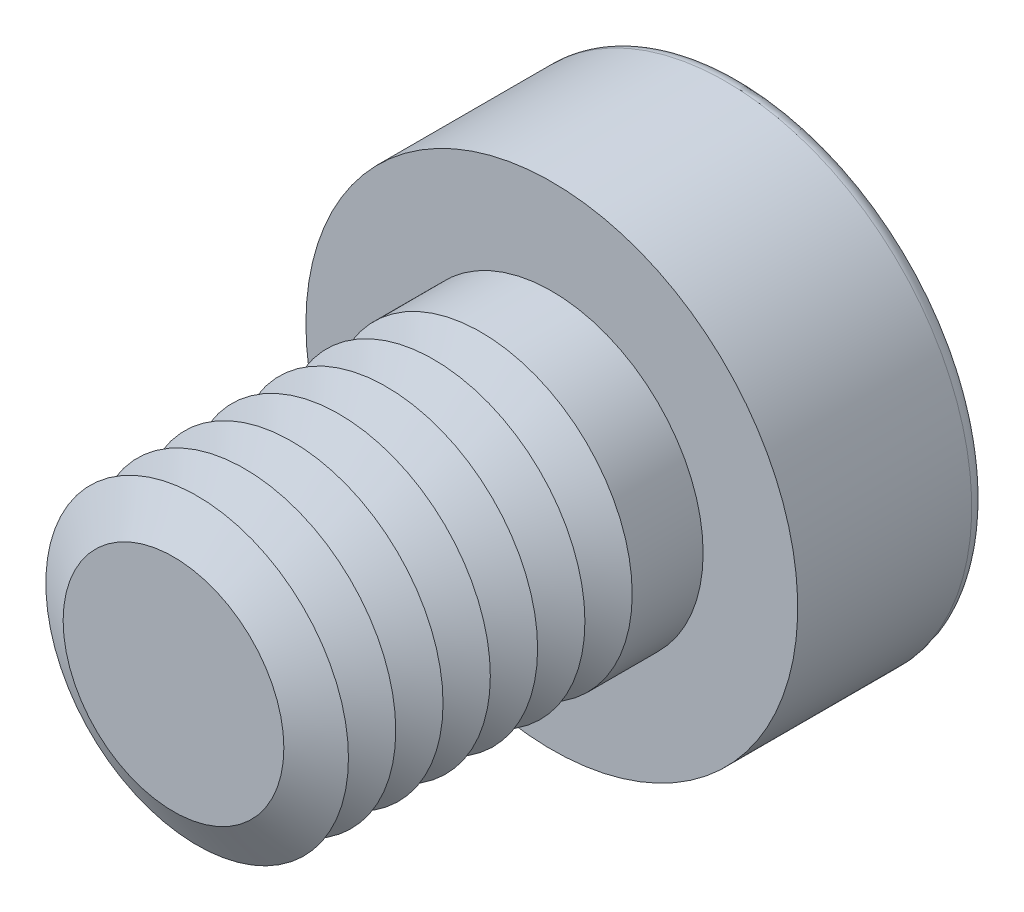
ISO-10303-21;
HEADER;
FILE_DESCRIPTION(('STEP AP214'),'2;1');
FILE_NAME('part.step','',(''),(''),'','','');
FILE_SCHEMA(('AUTOMOTIVE_DESIGN { 1 0 10303 214 1 1 1 1 }'));
ENDSEC;
DATA;
#1=APPLICATION_CONTEXT('core data for automotive mechanical design processes');
#2=APPLICATION_PROTOCOL_DEFINITION('international standard','automotive_design',2000,#1);
#3=PRODUCT_CONTEXT('',#1,'mechanical');
#4=PRODUCT('Part','Part','',(#3));
#5=PRODUCT_RELATED_PRODUCT_CATEGORY('part','',(#4));
#6=PRODUCT_DEFINITION_FORMATION('','',#4);
#7=PRODUCT_DEFINITION_CONTEXT('part definition',#1,'design');
#8=PRODUCT_DEFINITION('design','',#6,#7);
#9=PRODUCT_DEFINITION_SHAPE('','',#8);
#10=(LENGTH_UNIT() NAMED_UNIT(*) SI_UNIT(.MILLI.,.METRE.));
#11=(NAMED_UNIT(*) PLANE_ANGLE_UNIT() SI_UNIT($,.RADIAN.));
#12=(NAMED_UNIT(*) SI_UNIT($,.STERADIAN.) SOLID_ANGLE_UNIT());
#13=UNCERTAINTY_MEASURE_WITH_UNIT(LENGTH_MEASURE(1.E-05),#10,'distance_accuracy_value','');
#14=(GEOMETRIC_REPRESENTATION_CONTEXT(3) GLOBAL_UNCERTAINTY_ASSIGNED_CONTEXT((#13)) GLOBAL_UNIT_ASSIGNED_CONTEXT((#10,
#11,#12)) REPRESENTATION_CONTEXT('',''));
#15=CARTESIAN_POINT('',(0.,0.,0.));
#16=DIRECTION('',(0.,0.,1.));
#17=DIRECTION('',(1.,0.,0.));
#18=AXIS2_PLACEMENT_3D('',#15,#16,#17);
#19=CARTESIAN_POINT('',(0.,0.,5.625));
#20=DIRECTION('',(0.,0.,1.));
#21=DIRECTION('',(1.,0.,0.));
#22=AXIS2_PLACEMENT_3D('',#19,#20,#21);
#23=CONICAL_SURFACE('',#22,4.,1.0471975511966);
#24=CARTESIAN_POINT('',(0.,0.,5.));
#25=DIRECTION('',(0.,0.,1.));
#26=DIRECTION('',(1.,0.,0.));
#27=AXIS2_PLACEMENT_3D('',#24,#25,#26);
#28=CIRCLE('',#27,2.91746824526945);
#29=CARTESIAN_POINT('',(2.91746824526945,0.,5.));
#30=VERTEX_POINT('',#29);
#31=EDGE_CURVE('E313',#30,#30,#28,.T.);
#32=ORIENTED_EDGE('',*,*,#31,.T.);
#33=EDGE_LOOP('',(#32));
#34=FACE_BOUND('',#33,.T.);
#35=CARTESIAN_POINT('',(0.,0.,5.625));
#36=DIRECTION('',(0.,0.,1.));
#37=DIRECTION('',(1.,0.,0.));
#38=AXIS2_PLACEMENT_3D('',#35,#36,#37);
#39=CIRCLE('',#38,4.);
#40=CARTESIAN_POINT('',(4.,0.,5.625));
#41=VERTEX_POINT('',#40);
#42=EDGE_CURVE('E316',#41,#41,#39,.T.);
#43=ORIENTED_EDGE('',*,*,#42,.F.);
#44=EDGE_LOOP('',(#43));
#45=FACE_BOUND('',#44,.T.);
#46=ADVANCED_FACE('F39',(#34,#45),#23,.T.);
#47=CARTESIAN_POINT('',(0.,0.,5.));
#48=DIRECTION('',(0.,0.,-1.));
#49=DIRECTION('',(-1.,0.,0.));
#50=AXIS2_PLACEMENT_3D('',#47,#48,#49);
#51=CONICAL_SURFACE('',#50,2.91746824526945,1.0471975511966);
#52=CARTESIAN_POINT('',(0.,0.,4.375));
#53=DIRECTION('',(0.,0.,1.));
#54=DIRECTION('',(1.,0.,0.));
#55=AXIS2_PLACEMENT_3D('',#52,#53,#54);
#56=CIRCLE('',#55,4.);
#57=CARTESIAN_POINT('',(4.,0.,4.375));
#58=VERTEX_POINT('',#57);
#59=EDGE_CURVE('E324',#58,#58,#56,.T.);
#60=ORIENTED_EDGE('',*,*,#59,.T.);
#61=EDGE_LOOP('',(#60));
#62=FACE_BOUND('',#61,.T.);
#63=ORIENTED_EDGE('',*,*,#31,.F.);
#64=EDGE_LOOP('',(#63));
#65=FACE_BOUND('',#64,.T.);
#66=ADVANCED_FACE('F245',(#62,#65),#51,.T.);
#67=CARTESIAN_POINT('',(0.,0.,10.));
#68=DIRECTION('',(0.,0.,1.));
#69=DIRECTION('',(1.,0.,0.));
#70=AXIS2_PLACEMENT_3D('',#67,#68,#69);
#71=PLANE('',#70);
#72=CARTESIAN_POINT('',(0.,0.,10.));
#73=DIRECTION('',(0.,0.,1.));
#74=DIRECTION('',(1.,0.,0.));
#75=AXIS2_PLACEMENT_3D('',#72,#73,#74);
#76=CIRCLE('',#75,2.91746824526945);
#77=CARTESIAN_POINT('',(2.91746824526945,0.,10.));
#78=VERTEX_POINT('',#77);
#79=EDGE_CURVE('E174',#78,#78,#76,.T.);
#80=ORIENTED_EDGE('',*,*,#79,.T.);
#81=EDGE_LOOP('',(#80));
#82=FACE_BOUND('',#81,.T.);
#83=ADVANCED_FACE('F251',(#82),#71,.T.);
#84=CARTESIAN_POINT('',(0.,0.,10.));
#85=DIRECTION('',(0.,0.,-1.));
#86=DIRECTION('',(-1.,0.,0.));
#87=AXIS2_PLACEMENT_3D('',#84,#85,#86);
#88=CONICAL_SURFACE('',#87,2.91746824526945,1.0471975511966);
#89=CARTESIAN_POINT('',(0.,0.,9.375));
#90=DIRECTION('',(0.,0.,1.));
#91=DIRECTION('',(1.,0.,0.));
#92=AXIS2_PLACEMENT_3D('',#89,#90,#91);
#93=CIRCLE('',#92,4.);
#94=CARTESIAN_POINT('',(4.,0.,9.375));
#95=VERTEX_POINT('',#94);
#96=EDGE_CURVE('E291',#95,#95,#93,.T.);
#97=ORIENTED_EDGE('',*,*,#96,.T.);
#98=EDGE_LOOP('',(#97));
#99=FACE_BOUND('',#98,.T.);
#100=ORIENTED_EDGE('',*,*,#79,.F.);
#101=EDGE_LOOP('',(#100));
#102=FACE_BOUND('',#101,.T.);
#103=ADVANCED_FACE('F199',(#99,#102),#88,.T.);
#104=CARTESIAN_POINT('',(0.,0.,9.375));
#105=DIRECTION('',(0.,0.,1.));
#106=DIRECTION('',(1.,0.,0.));
#107=AXIS2_PLACEMENT_3D('',#104,#105,#106);
#108=CONICAL_SURFACE('',#107,4.,1.0471975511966);
#109=CARTESIAN_POINT('',(0.,0.,8.75));
#110=DIRECTION('',(0.,0.,1.));
#111=DIRECTION('',(1.,0.,0.));
#112=AXIS2_PLACEMENT_3D('',#109,#110,#111);
#113=CIRCLE('',#112,2.91746824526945);
#114=CARTESIAN_POINT('',(2.91746824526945,0.,8.75));
#115=VERTEX_POINT('',#114);
#116=EDGE_CURVE('E288',#115,#115,#113,.T.);
#117=ORIENTED_EDGE('',*,*,#116,.T.);
#118=EDGE_LOOP('',(#117));
#119=FACE_BOUND('',#118,.T.);
#120=ORIENTED_EDGE('',*,*,#96,.F.);
#121=EDGE_LOOP('',(#120));
#122=FACE_BOUND('',#121,.T.);
#123=ADVANCED_FACE('F277',(#119,#122),#108,.T.);
#124=CARTESIAN_POINT('',(0.,0.,8.75));
#125=DIRECTION('',(0.,0.,-1.));
#126=DIRECTION('',(-1.,0.,0.));
#127=AXIS2_PLACEMENT_3D('',#124,#125,#126);
#128=CONICAL_SURFACE('',#127,2.91746824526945,1.0471975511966);
#129=CARTESIAN_POINT('',(0.,0.,8.125));
#130=DIRECTION('',(0.,0.,1.));
#131=DIRECTION('',(1.,0.,0.));
#132=AXIS2_PLACEMENT_3D('',#129,#130,#131);
#133=CIRCLE('',#132,4.);
#134=CARTESIAN_POINT('',(4.,0.,8.125));
#135=VERTEX_POINT('',#134);
#136=EDGE_CURVE('E300',#135,#135,#133,.T.);
#137=ORIENTED_EDGE('',*,*,#136,.T.);
#138=EDGE_LOOP('',(#137));
#139=FACE_BOUND('',#138,.T.);
#140=ORIENTED_EDGE('',*,*,#116,.F.);
#141=EDGE_LOOP('',(#140));
#142=FACE_BOUND('',#141,.T.);
#143=ADVANCED_FACE('F274',(#139,#142),#128,.T.);
#144=CARTESIAN_POINT('',(0.,0.,8.125));
#145=DIRECTION('',(0.,0.,1.));
#146=DIRECTION('',(1.,0.,0.));
#147=AXIS2_PLACEMENT_3D('',#144,#145,#146);
#148=CONICAL_SURFACE('',#147,4.,1.0471975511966);
#149=CARTESIAN_POINT('',(0.,0.,7.5));
#150=DIRECTION('',(0.,0.,1.));
#151=DIRECTION('',(1.,0.,0.));
#152=AXIS2_PLACEMENT_3D('',#149,#150,#151);
#153=CIRCLE('',#152,2.91746824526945);
#154=CARTESIAN_POINT('',(2.91746824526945,0.,7.5));
#155=VERTEX_POINT('',#154);
#156=EDGE_CURVE('E293',#155,#155,#153,.T.);
#157=ORIENTED_EDGE('',*,*,#156,.T.);
#158=EDGE_LOOP('',(#157));
#159=FACE_BOUND('',#158,.T.);
#160=ORIENTED_EDGE('',*,*,#136,.F.);
#161=EDGE_LOOP('',(#160));
#162=FACE_BOUND('',#161,.T.);
#163=ADVANCED_FACE('F270',(#159,#162),#148,.T.);
#164=CARTESIAN_POINT('',(0.,0.,7.5));
#165=DIRECTION('',(0.,0.,-1.));
#166=DIRECTION('',(-1.,0.,0.));
#167=AXIS2_PLACEMENT_3D('',#164,#165,#166);
#168=CONICAL_SURFACE('',#167,2.91746824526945,1.0471975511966);
#169=CARTESIAN_POINT('',(0.,0.,6.875));
#170=DIRECTION('',(0.,0.,1.));
#171=DIRECTION('',(1.,0.,0.));
#172=AXIS2_PLACEMENT_3D('',#169,#170,#171);
#173=CIRCLE('',#172,4.);
#174=CARTESIAN_POINT('',(4.,0.,6.875));
#175=VERTEX_POINT('',#174);
#176=EDGE_CURVE('E309',#175,#175,#173,.T.);
#177=ORIENTED_EDGE('',*,*,#176,.T.);
#178=EDGE_LOOP('',(#177));
#179=FACE_BOUND('',#178,.T.);
#180=ORIENTED_EDGE('',*,*,#156,.F.);
#181=EDGE_LOOP('',(#180));
#182=FACE_BOUND('',#181,.T.);
#183=ADVANCED_FACE('F266',(#179,#182),#168,.T.);
#184=CARTESIAN_POINT('',(0.,0.,6.875));
#185=DIRECTION('',(0.,0.,1.));
#186=DIRECTION('',(1.,0.,0.));
#187=AXIS2_PLACEMENT_3D('',#184,#185,#186);
#188=CONICAL_SURFACE('',#187,4.,1.0471975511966);
#189=CARTESIAN_POINT('',(0.,0.,6.25));
#190=DIRECTION('',(0.,0.,1.));
#191=DIRECTION('',(1.,0.,0.));
#192=AXIS2_PLACEMENT_3D('',#189,#190,#191);
#193=CIRCLE('',#192,2.91746824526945);
#194=CARTESIAN_POINT('',(2.91746824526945,0.,6.25));
#195=VERTEX_POINT('',#194);
#196=EDGE_CURVE('E305',#195,#195,#193,.T.);
#197=ORIENTED_EDGE('',*,*,#196,.T.);
#198=EDGE_LOOP('',(#197));
#199=FACE_BOUND('',#198,.T.);
#200=ORIENTED_EDGE('',*,*,#176,.F.);
#201=EDGE_LOOP('',(#200));
#202=FACE_BOUND('',#201,.T.);
#203=ADVANCED_FACE('F262',(#199,#202),#188,.T.);
#204=CARTESIAN_POINT('',(0.,0.,6.25));
#205=DIRECTION('',(0.,0.,-1.));
#206=DIRECTION('',(-1.,0.,0.));
#207=AXIS2_PLACEMENT_3D('',#204,#205,#206);
#208=CONICAL_SURFACE('',#207,2.91746824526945,1.0471975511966);
#209=ORIENTED_EDGE('',*,*,#42,.T.);
#210=EDGE_LOOP('',(#209));
#211=FACE_BOUND('',#210,.T.);
#212=ORIENTED_EDGE('',*,*,#196,.F.);
#213=EDGE_LOOP('',(#212));
#214=FACE_BOUND('',#213,.T.);
#215=ADVANCED_FACE('F258',(#211,#214),#208,.T.);
#216=CARTESIAN_POINT('',(0.,0.,4.375));
#217=DIRECTION('',(0.,0.,1.));
#218=DIRECTION('',(1.,0.,0.));
#219=AXIS2_PLACEMENT_3D('',#216,#217,#218);
#220=CONICAL_SURFACE('',#219,4.,1.0471975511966);
#221=CARTESIAN_POINT('',(0.,0.,3.75));
#222=DIRECTION('',(0.,0.,1.));
#223=DIRECTION('',(1.,0.,0.));
#224=AXIS2_PLACEMENT_3D('',#221,#222,#223);
#225=CIRCLE('',#224,2.91746824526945);
#226=CARTESIAN_POINT('',(2.91746824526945,0.,3.75));
#227=VERTEX_POINT('',#226);
#228=EDGE_CURVE('E320',#227,#227,#225,.T.);
#229=ORIENTED_EDGE('',*,*,#228,.T.);
#230=EDGE_LOOP('',(#229));
#231=FACE_BOUND('',#230,.T.);
#232=ORIENTED_EDGE('',*,*,#59,.F.);
#233=EDGE_LOOP('',(#232));
#234=FACE_BOUND('',#233,.T.);
#235=ADVANCED_FACE('F261',(#231,#234),#220,.T.);
#236=CARTESIAN_POINT('',(0.,0.,3.75));
#237=DIRECTION('',(0.,0.,-1.));
#238=DIRECTION('',(-1.,0.,0.));
#239=AXIS2_PLACEMENT_3D('',#236,#237,#238);
#240=CONICAL_SURFACE('',#239,2.91746824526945,1.0471975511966);
#241=CARTESIAN_POINT('',(0.,0.,3.125));
#242=DIRECTION('',(0.,0.,1.));
#243=DIRECTION('',(1.,0.,0.));
#244=AXIS2_PLACEMENT_3D('',#241,#242,#243);
#245=CIRCLE('',#244,4.);
#246=CARTESIAN_POINT('',(4.,0.,3.125));
#247=VERTEX_POINT('',#246);
#248=EDGE_CURVE('E336',#247,#247,#245,.T.);
#249=ORIENTED_EDGE('',*,*,#248,.T.);
#250=EDGE_LOOP('',(#249));
#251=FACE_BOUND('',#250,.T.);
#252=ORIENTED_EDGE('',*,*,#228,.F.);
#253=EDGE_LOOP('',(#252));
#254=FACE_BOUND('',#253,.T.);
#255=ADVANCED_FACE('F342',(#251,#254),#240,.T.);
#256=CARTESIAN_POINT('',(0.,0.,3.125));
#257=DIRECTION('',(0.,0.,1.));
#258=DIRECTION('',(1.,0.,0.));
#259=AXIS2_PLACEMENT_3D('',#256,#257,#258);
#260=CONICAL_SURFACE('',#259,4.,1.0471975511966);
#261=CARTESIAN_POINT('',(0.,0.,2.5));
#262=DIRECTION('',(0.,0.,1.));
#263=DIRECTION('',(1.,0.,0.));
#264=AXIS2_PLACEMENT_3D('',#261,#262,#263);
#265=CIRCLE('',#264,2.91746824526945);
#266=CARTESIAN_POINT('',(2.91746824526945,0.,2.5));
#267=VERTEX_POINT('',#266);
#268=EDGE_CURVE('E328',#267,#267,#265,.T.);
#269=ORIENTED_EDGE('',*,*,#268,.T.);
#270=EDGE_LOOP('',(#269));
#271=FACE_BOUND('',#270,.T.);
#272=ORIENTED_EDGE('',*,*,#248,.F.);
#273=EDGE_LOOP('',(#272));
#274=FACE_BOUND('',#273,.T.);
#275=ADVANCED_FACE('F345',(#271,#274),#260,.T.);
#276=CARTESIAN_POINT('',(0.,0.,2.5));
#277=DIRECTION('',(0.,0.,-1.));
#278=DIRECTION('',(-1.,0.,0.));
#279=AXIS2_PLACEMENT_3D('',#276,#277,#278);
#280=CONICAL_SURFACE('',#279,2.91746824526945,1.0471975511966);
#281=CARTESIAN_POINT('',(0.,0.,1.875));
#282=DIRECTION('',(0.,0.,1.));
#283=DIRECTION('',(1.,0.,0.));
#284=AXIS2_PLACEMENT_3D('',#281,#282,#283);
#285=CIRCLE('',#284,4.);
#286=CARTESIAN_POINT('',(4.,0.,1.875));
#287=VERTEX_POINT('',#286);
#288=EDGE_CURVE('E332',#287,#287,#285,.T.);
#289=ORIENTED_EDGE('',*,*,#288,.T.);
#290=EDGE_LOOP('',(#289));
#291=FACE_BOUND('',#290,.T.);
#292=ORIENTED_EDGE('',*,*,#268,.F.);
#293=EDGE_LOOP('',(#292));
#294=FACE_BOUND('',#293,.T.);
#295=ADVANCED_FACE('F347',(#291,#294),#280,.T.);
#296=CARTESIAN_POINT('',(0.,0.,-1.25));
#297=DIRECTION('',(0.,0.,-1.));
#298=DIRECTION('',(-1.,0.,0.));
#299=AXIS2_PLACEMENT_3D('',#296,#297,#298);
#300=CONICAL_SURFACE('',#299,2.5,1.0471975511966);
#301=CARTESIAN_POINT('',(0.,0.,0.193375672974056));
#302=VERTEX_POINT('',#301);
#303=VERTEX_LOOP('',#302);
#304=FACE_BOUND('',#303,.T.);
#305=CARTESIAN_POINT('',(0.,0.,-1.25));
#306=DIRECTION('',(0.,0.,-1.));
#307=DIRECTION('',(-1.,0.,0.));
#308=AXIS2_PLACEMENT_3D('',#305,#306,#307);
#309=CIRCLE('',#308,2.5);
#310=CARTESIAN_POINT('',(-2.1650635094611,1.25,-1.25));
#311=VERTEX_POINT('',#310);
#312=CARTESIAN_POINT('',(0.,2.5,-1.25));
#313=VERTEX_POINT('',#312);
#314=EDGE_CURVE('E149',#311,#313,#309,.T.);
#315=ORIENTED_EDGE('',*,*,#314,.T.);
#316=CARTESIAN_POINT('',(0.,0.,-1.25));
#317=DIRECTION('',(0.,0.,-1.));
#318=DIRECTION('',(-1.,0.,0.));
#319=AXIS2_PLACEMENT_3D('',#316,#317,#318);
#320=CIRCLE('',#319,2.5);
#321=CARTESIAN_POINT('',(2.1650635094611,1.25,-1.25));
#322=VERTEX_POINT('',#321);
#323=EDGE_CURVE('E54',#313,#322,#320,.T.);
#324=ORIENTED_EDGE('',*,*,#323,.T.);
#325=CARTESIAN_POINT('',(2.1650635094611,-1.25,-1.25));
#326=VERTEX_POINT('',#325);
#327=EDGE_CURVE('E727',#322,#326,#320,.T.);
#328=ORIENTED_EDGE('',*,*,#327,.T.);
#329=CARTESIAN_POINT('',(0.,-2.5,-1.25));
#330=VERTEX_POINT('',#329);
#331=EDGE_CURVE('E726',#326,#330,#320,.T.);
#332=ORIENTED_EDGE('',*,*,#331,.T.);
#333=CARTESIAN_POINT('',(-2.1650635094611,-1.25,-1.25));
#334=VERTEX_POINT('',#333);
#335=EDGE_CURVE('E720',#330,#334,#320,.T.);
#336=ORIENTED_EDGE('',*,*,#335,.T.);
#337=EDGE_CURVE('E719',#334,#311,#320,.T.);
#338=ORIENTED_EDGE('',*,*,#337,.T.);
#339=EDGE_LOOP('',(#315,#324,#328,#332,#336,#338));
#340=FACE_BOUND('',#339,.T.);
#341=ADVANCED_FACE('F201',(#304,#340),#300,.F.);
#342=CARTESIAN_POINT('',(0.,0.,-1.25));
#343=DIRECTION('',(0.,0.,-1.));
#344=DIRECTION('',(-1.,0.,0.));
#345=AXIS2_PLACEMENT_3D('',#342,#343,#344);
#346=PLANE('',#345);
#347=ORIENTED_EDGE('',*,*,#323,.F.);
#348=DIRECTION('',(1.,0.,0.));
#349=VECTOR('',#348,1.);
#350=CARTESIAN_POINT('',(-1.44337567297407,2.5,-1.25));
#351=LINE('',#350,#349);
#352=CARTESIAN_POINT('',(1.44337567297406,2.5,-1.25));
#353=VERTEX_POINT('',#352);
#354=EDGE_CURVE('E767',#313,#353,#351,.T.);
#355=ORIENTED_EDGE('',*,*,#354,.T.);
#356=DIRECTION('',(0.5,-0.866025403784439,0.));
#357=VECTOR('',#356,1.);
#358=CARTESIAN_POINT('',(1.44337567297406,2.5,-1.25));
#359=LINE('',#358,#357);
#360=EDGE_CURVE('E155',#353,#322,#359,.T.);
#361=ORIENTED_EDGE('',*,*,#360,.T.);
#362=EDGE_LOOP('',(#347,#355,#361));
#363=FACE_BOUND('',#362,.T.);
#364=ADVANCED_FACE('F387',(#363),#346,.T.);
#365=ORIENTED_EDGE('',*,*,#327,.F.);
#366=CARTESIAN_POINT('',(2.88675134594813,0.,-1.25));
#367=VERTEX_POINT('',#366);
#368=EDGE_CURVE('E762',#322,#367,#359,.T.);
#369=ORIENTED_EDGE('',*,*,#368,.T.);
#370=DIRECTION('',(-0.5,-0.866025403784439,0.));
#371=VECTOR('',#370,1.);
#372=CARTESIAN_POINT('',(2.88675134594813,0.,-1.25));
#373=LINE('',#372,#371);
#374=EDGE_CURVE('E738',#367,#326,#373,.T.);
#375=ORIENTED_EDGE('',*,*,#374,.T.);
#376=EDGE_LOOP('',(#365,#369,#375));
#377=FACE_BOUND('',#376,.T.);
#378=ADVANCED_FACE('F397',(#377),#346,.T.);
#379=ORIENTED_EDGE('',*,*,#331,.F.);
#380=CARTESIAN_POINT('',(1.44337567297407,-2.5,-1.25));
#381=VERTEX_POINT('',#380);
#382=EDGE_CURVE('E740',#326,#381,#373,.T.);
#383=ORIENTED_EDGE('',*,*,#382,.T.);
#384=DIRECTION('',(-1.,0.,0.));
#385=VECTOR('',#384,1.);
#386=CARTESIAN_POINT('',(1.44337567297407,-2.5,-1.25));
#387=LINE('',#386,#385);
#388=EDGE_CURVE('E694',#381,#330,#387,.T.);
#389=ORIENTED_EDGE('',*,*,#388,.T.);
#390=EDGE_LOOP('',(#379,#383,#389));
#391=FACE_BOUND('',#390,.T.);
#392=ADVANCED_FACE('F407',(#391),#346,.T.);
#393=ORIENTED_EDGE('',*,*,#335,.F.);
#394=CARTESIAN_POINT('',(-1.44337567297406,-2.5,-1.25));
#395=VERTEX_POINT('',#394);
#396=EDGE_CURVE('E735',#330,#395,#387,.T.);
#397=ORIENTED_EDGE('',*,*,#396,.T.);
#398=DIRECTION('',(-0.5,0.866025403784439,0.));
#399=VECTOR('',#398,1.);
#400=CARTESIAN_POINT('',(-1.44337567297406,-2.5,-1.25));
#401=LINE('',#400,#399);
#402=EDGE_CURVE('E737',#395,#334,#401,.T.);
#403=ORIENTED_EDGE('',*,*,#402,.T.);
#404=EDGE_LOOP('',(#393,#397,#403));
#405=FACE_BOUND('',#404,.T.);
#406=ADVANCED_FACE('F415',(#405),#346,.T.);
#407=ORIENTED_EDGE('',*,*,#337,.F.);
#408=CARTESIAN_POINT('',(-2.88675134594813,0.,-1.25));
#409=VERTEX_POINT('',#408);
#410=EDGE_CURVE('E742',#334,#409,#401,.T.);
#411=ORIENTED_EDGE('',*,*,#410,.T.);
#412=DIRECTION('',(0.5,0.866025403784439,0.));
#413=VECTOR('',#412,1.);
#414=CARTESIAN_POINT('',(-2.88675134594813,0.,-1.25));
#415=LINE('',#414,#413);
#416=EDGE_CURVE('E158',#409,#311,#415,.T.);
#417=ORIENTED_EDGE('',*,*,#416,.T.);
#418=EDGE_LOOP('',(#407,#411,#417));
#419=FACE_BOUND('',#418,.T.);
#420=ADVANCED_FACE('F231',(#419),#346,.T.);
#421=ORIENTED_EDGE('',*,*,#314,.F.);
#422=CARTESIAN_POINT('',(-1.44337567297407,2.5,-1.25));
#423=VERTEX_POINT('',#422);
#424=EDGE_CURVE('E748',#311,#423,#415,.T.);
#425=ORIENTED_EDGE('',*,*,#424,.T.);
#426=EDGE_CURVE('E763',#423,#313,#351,.T.);
#427=ORIENTED_EDGE('',*,*,#426,.T.);
#428=EDGE_LOOP('',(#421,#425,#427));
#429=FACE_BOUND('',#428,.T.);
#430=ADVANCED_FACE('F399',(#429),#346,.T.);
#431=CARTESIAN_POINT('',(-1.44337567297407,2.5,-1.25));
#432=DIRECTION('',(0.,1.,0.));
#433=DIRECTION('',(0.,0.,1.));
#434=AXIS2_PLACEMENT_3D('',#431,#432,#433);
#435=PLANE('',#434);
#436=DIRECTION('',(0.,0.,-1.));
#437=VECTOR('',#436,1.);
#438=CARTESIAN_POINT('',(-1.44337567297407,2.5,-1.25));
#439=LINE('',#438,#437);
#440=CARTESIAN_POINT('',(-1.44337567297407,2.5,-5.));
#441=VERTEX_POINT('',#440);
#442=EDGE_CURVE('E147',#423,#441,#439,.T.);
#443=ORIENTED_EDGE('',*,*,#442,.T.);
#444=CARTESIAN_POINT('',(-3.76800948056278,2.5,-5.43814611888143));
#445=CARTESIAN_POINT('',(-3.65512241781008,2.5,-5.41294788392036));
#446=CARTESIAN_POINT('',(-3.54216337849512,2.5,-5.38806689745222));
#447=CARTESIAN_POINT('',(-3.31606595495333,2.5,-5.33910944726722));
#448=CARTESIAN_POINT('',(-3.202927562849,2.5,-5.31503301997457));
#449=CARTESIAN_POINT('',(-2.97632910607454,2.5,-5.26783262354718));
#450=CARTESIAN_POINT('',(-2.86286882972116,2.5,-5.24470966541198));
#451=CARTESIAN_POINT('',(-2.63570880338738,2.5,-5.19967851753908));
#452=CARTESIAN_POINT('',(-2.52200905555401,2.5,-5.17777031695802));
#453=CARTESIAN_POINT('',(-2.18246936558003,2.5,-5.11464083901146));
#454=CARTESIAN_POINT('',(-1.95621666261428,2.5,-5.07559469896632));
#455=CARTESIAN_POINT('',(-1.50233128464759,2.5,-5.00642421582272));
#456=CARTESIAN_POINT('',(-1.27469889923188,2.5,-4.97629806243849));
#457=CARTESIAN_POINT('',(-0.930935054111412,2.5,-4.9407375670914));
#458=CARTESIAN_POINT('',(-0.815306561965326,2.5,-4.93045885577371));
#459=CARTESIAN_POINT('',(-0.58377590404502,2.5,-4.91374261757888));
#460=CARTESIAN_POINT('',(-0.467873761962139,2.5,-4.9073047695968));
#461=CARTESIAN_POINT('',(-0.235955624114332,2.5,-4.89864425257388));
#462=CARTESIAN_POINT('',(-0.119939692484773,2.5,-4.89641989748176));
#463=CARTESIAN_POINT('',(0.112094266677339,2.5,-4.89632233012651));
#464=CARTESIAN_POINT('',(0.228112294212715,2.5,-4.89844912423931));
#465=CARTESIAN_POINT('',(0.460464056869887,2.5,-4.90693624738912));
#466=CARTESIAN_POINT('',(0.57679715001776,2.5,-4.91331380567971));
#467=CARTESIAN_POINT('',(0.809186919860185,2.5,-4.92994602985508));
#468=CARTESIAN_POINT('',(0.925243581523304,2.5,-4.94020090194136));
#469=CARTESIAN_POINT('',(1.15707831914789,2.5,-4.96408095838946));
#470=CARTESIAN_POINT('',(1.27285617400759,2.5,-4.97770825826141));
#471=CARTESIAN_POINT('',(1.50403978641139,2.5,-5.0077859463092));
#472=CARTESIAN_POINT('',(1.61944554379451,2.5,-5.02423633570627));
#473=CARTESIAN_POINT('',(1.97116037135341,2.5,-5.07794848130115));
#474=CARTESIAN_POINT('',(2.20690405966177,2.5,-5.11889404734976));
#475=CARTESIAN_POINT('',(2.67723558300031,2.5,-5.2069642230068));
#476=CARTESIAN_POINT('',(2.9118232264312,2.5,-5.25408982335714));
#477=CARTESIAN_POINT('',(3.38022088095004,2.5,-5.35235327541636));
#478=CARTESIAN_POINT('',(3.61403064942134,2.5,-5.40349227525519));
#479=CARTESIAN_POINT('',(4.08105387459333,2.5,-5.50842823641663));
#480=CARTESIAN_POINT('',(4.31426731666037,2.5,-5.56222526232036));
#481=CARTESIAN_POINT('',(4.77742011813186,2.5,-5.67097662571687));
#482=CARTESIAN_POINT('',(5.00736469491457,2.5,-5.72590882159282));
#483=CARTESIAN_POINT('',(5.46695141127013,2.5,-5.83704335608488));
#484=CARTESIAN_POINT('',(5.69659354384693,2.5,-5.89324572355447));
#485=CARTESIAN_POINT('',(6.15532898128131,2.5,-6.00649703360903));
#486=CARTESIAN_POINT('',(6.3844226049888,2.5,-6.06354468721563));
#487=CARTESIAN_POINT('',(6.84242442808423,2.5,-6.17834514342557));
#488=CARTESIAN_POINT('',(7.07133263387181,2.5,-6.23609792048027));
#489=CARTESIAN_POINT('',(7.30017784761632,2.5,-6.29409642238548));
#490=B_SPLINE_CURVE_WITH_KNOTS('',3,(#444,#445,#446,#447,#448,#449,#450,#451,#452,#453,#454,
#455,#456,#457,#458,#459,#460,#461,#462,#463,#464,#465,#466,#467,#468,#469,#470,#471,#472,#473,
#474,#475,#476,#477,#478,#479,#480,#481,#482,#483,#484,#485,#486,#487,#488,#489),.UNSPECIFIED.,
.F.,.F.,(4,2,2,2,2,2,2,2,2,2,2,2,2,2,2,2,2,2,2,2,2,2,4),(0.,0.346996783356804,0.694009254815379,
1.04138068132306,1.38874900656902,2.07743762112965,2.76598637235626,3.11418615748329,
3.46235682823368,3.81038814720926,4.15841997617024,4.50787110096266,4.85734081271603,
5.20703030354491,5.55671994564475,6.27438533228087,6.99216591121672,7.71015258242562,
8.42815670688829,9.13739674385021,9.84665290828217,10.5549206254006,11.2631627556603),.UNSPECIFIED.);
#491=CARTESIAN_POINT('',(1.44337567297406,2.5,-5.));
#492=VERTEX_POINT('',#491);
#493=EDGE_CURVE('E124',#441,#492,#490,.T.);
#494=ORIENTED_EDGE('',*,*,#493,.T.);
#495=DIRECTION('',(0.,0.,-1.));
#496=VECTOR('',#495,1.);
#497=CARTESIAN_POINT('',(1.44337567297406,2.5,-1.25));
#498=LINE('',#497,#496);
#499=EDGE_CURVE('E143',#353,#492,#498,.T.);
#500=ORIENTED_EDGE('',*,*,#499,.F.);
#501=ORIENTED_EDGE('',*,*,#354,.F.);
#502=ORIENTED_EDGE('',*,*,#426,.F.);
#503=EDGE_LOOP('',(#443,#494,#500,#501,#502));
#504=FACE_BOUND('',#503,.T.);
#505=ADVANCED_FACE('F141',(#504),#435,.F.);
#506=CARTESIAN_POINT('',(1.44337567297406,2.5,-1.25));
#507=DIRECTION('',(0.866025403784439,0.5,0.));
#508=DIRECTION('',(-0.5,0.866025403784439,0.));
#509=AXIS2_PLACEMENT_3D('',#506,#507,#508);
#510=PLANE('',#509);
#511=ORIENTED_EDGE('',*,*,#499,.T.);
#512=CARTESIAN_POINT('',(1.44326020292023,2.5002,-5.00003094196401));
#513=CARTESIAN_POINT('',(1.50320952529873,2.3963647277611,-4.98395956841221));
#514=CARTESIAN_POINT('',(1.56326755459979,2.29234116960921,-4.96936932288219));
#515=CARTESIAN_POINT('',(1.68359574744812,2.08392662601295,-4.94373552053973));
#516=CARTESIAN_POINT('',(1.7438659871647,1.97953550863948,-4.93269340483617));
#517=CARTESIAN_POINT('',(1.86425311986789,1.77101887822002,-4.91480059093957));
#518=CARTESIAN_POINT('',(1.9243691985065,1.66689477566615,-4.90792855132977));
#519=CARTESIAN_POINT('',(2.04467803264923,1.45851376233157,-4.89871383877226));
#520=CARTESIAN_POINT('',(2.10487077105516,1.35425688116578,-4.89637028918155));
#521=CARTESIAN_POINT('',(2.22525624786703,1.14574311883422,-4.89637028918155));
#522=CARTESIAN_POINT('',(2.28544898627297,1.04148623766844,-4.89871383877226));
#523=CARTESIAN_POINT('',(2.40575782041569,0.833105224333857,-4.90792855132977));
#524=CARTESIAN_POINT('',(2.4658738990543,0.728981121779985,-4.91480059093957));
#525=CARTESIAN_POINT('',(2.58626103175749,0.520464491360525,-4.93269340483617));
#526=CARTESIAN_POINT('',(2.64653127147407,0.41607337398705,-4.94373552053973));
#527=CARTESIAN_POINT('',(2.7668594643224,0.207658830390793,-4.96936932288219));
#528=CARTESIAN_POINT('',(2.82691749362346,0.103635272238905,-4.98395956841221));
#529=CARTESIAN_POINT('',(2.88686681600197,-0.00019999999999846,-5.00003094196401));
#530=B_SPLINE_CURVE_WITH_KNOTS('',3,(#512,#513,#514,#515,#516,#517,#518,#519,#520,#521,#522,
#523,#524,#525,#526,#527,#528,#529),.UNSPECIFIED.,.F.,.F.,(4,2,2,2,2,2,2,2,4),(0.,
0.362931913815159,0.726011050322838,1.08721601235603,1.44835104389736,1.80948607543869,
2.17069103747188,2.53377017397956,2.89670208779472),.UNSPECIFIED.);
#531=CARTESIAN_POINT('',(2.88675134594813,0.,-5.));
#532=VERTEX_POINT('',#531);
#533=EDGE_CURVE('E11',#492,#532,#530,.T.);
#534=ORIENTED_EDGE('',*,*,#533,.T.);
#535=DIRECTION('',(0.,0.,-1.));
#536=VECTOR('',#535,1.);
#537=CARTESIAN_POINT('',(2.88675134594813,0.,-1.25));
#538=LINE('',#537,#536);
#539=EDGE_CURVE('E157',#367,#532,#538,.T.);
#540=ORIENTED_EDGE('',*,*,#539,.F.);
#541=ORIENTED_EDGE('',*,*,#368,.F.);
#542=ORIENTED_EDGE('',*,*,#360,.F.);
#543=EDGE_LOOP('',(#511,#534,#540,#541,#542));
#544=FACE_BOUND('',#543,.T.);
#545=ADVANCED_FACE('F152',(#544),#510,.F.);
#546=CARTESIAN_POINT('',(2.88675134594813,0.,-1.25));
#547=DIRECTION('',(0.866025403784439,-0.5,0.));
#548=DIRECTION('',(0.5,0.866025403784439,0.));
#549=AXIS2_PLACEMENT_3D('',#546,#547,#548);
#550=PLANE('',#549);
#551=ORIENTED_EDGE('',*,*,#539,.T.);
#552=CARTESIAN_POINT('',(2.88686681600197,0.000200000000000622,-5.00003094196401));
#553=CARTESIAN_POINT('',(2.82691749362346,-0.103635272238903,-4.98395956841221));
#554=CARTESIAN_POINT('',(2.7668594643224,-0.207658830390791,-4.96936932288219));
#555=CARTESIAN_POINT('',(2.64653127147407,-0.416073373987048,-4.94373552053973));
#556=CARTESIAN_POINT('',(2.58626103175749,-0.520464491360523,-4.93269340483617));
#557=CARTESIAN_POINT('',(2.4658738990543,-0.728981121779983,-4.91480059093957));
#558=CARTESIAN_POINT('',(2.40575782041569,-0.833105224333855,-4.90792855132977));
#559=CARTESIAN_POINT('',(2.28544898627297,-1.04148623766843,-4.89871383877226));
#560=CARTESIAN_POINT('',(2.22525624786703,-1.14574311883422,-4.89637028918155));
#561=CARTESIAN_POINT('',(2.10487077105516,-1.35425688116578,-4.89637028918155));
#562=CARTESIAN_POINT('',(2.04467803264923,-1.45851376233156,-4.89871383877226));
#563=CARTESIAN_POINT('',(1.9243691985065,-1.66689477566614,-4.90792855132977));
#564=CARTESIAN_POINT('',(1.86425311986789,-1.77101887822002,-4.91480059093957));
#565=CARTESIAN_POINT('',(1.7438659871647,-1.97953550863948,-4.93269340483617));
#566=CARTESIAN_POINT('',(1.68359574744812,-2.08392662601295,-4.94373552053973));
#567=CARTESIAN_POINT('',(1.56326755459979,-2.29234116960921,-4.96936932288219));
#568=CARTESIAN_POINT('',(1.50320952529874,-2.3963647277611,-4.98395956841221));
#569=CARTESIAN_POINT('',(1.44326020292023,-2.5002,-5.00003094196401));
#570=B_SPLINE_CURVE_WITH_KNOTS('',3,(#552,#553,#554,#555,#556,#557,#558,#559,#560,#561,#562,
#563,#564,#565,#566,#567,#568,#569),.UNSPECIFIED.,.F.,.F.,(4,2,2,2,2,2,2,2,4),(0.,
0.362931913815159,0.726011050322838,1.08721601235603,1.44835104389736,1.80948607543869,
2.17069103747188,2.53377017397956,2.89670208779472),.UNSPECIFIED.);
#571=CARTESIAN_POINT('',(1.44337567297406,-2.5,-5.));
#572=VERTEX_POINT('',#571);
#573=EDGE_CURVE('E173',#532,#572,#570,.T.);
#574=ORIENTED_EDGE('',*,*,#573,.T.);
#575=DIRECTION('',(0.,0.,-1.));
#576=VECTOR('',#575,1.);
#577=CARTESIAN_POINT('',(1.44337567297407,-2.5,-1.25));
#578=LINE('',#577,#576);
#579=EDGE_CURVE('E689',#381,#572,#578,.T.);
#580=ORIENTED_EDGE('',*,*,#579,.F.);
#581=ORIENTED_EDGE('',*,*,#382,.F.);
#582=ORIENTED_EDGE('',*,*,#374,.F.);
#583=EDGE_LOOP('',(#551,#574,#580,#581,#582));
#584=FACE_BOUND('',#583,.T.);
#585=ADVANCED_FACE('F191',(#584),#550,.F.);
#586=CARTESIAN_POINT('',(1.44337567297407,-2.5,-1.25));
#587=DIRECTION('',(0.,-1.,0.));
#588=DIRECTION('',(1.,0.,0.));
#589=AXIS2_PLACEMENT_3D('',#586,#587,#588);
#590=PLANE('',#589);
#591=ORIENTED_EDGE('',*,*,#579,.T.);
#592=CARTESIAN_POINT('',(-3.76800948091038,-2.5,-5.43814611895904));
#593=CARTESIAN_POINT('',(-3.65512241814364,-2.5,-5.41294788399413));
#594=CARTESIAN_POINT('',(-3.54216337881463,-2.5,-5.38806689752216));
#595=CARTESIAN_POINT('',(-3.31606595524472,-2.5,-5.33910944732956));
#596=CARTESIAN_POINT('',(-3.20292756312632,-2.5,-5.31503302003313));
#597=CARTESIAN_POINT('',(-2.97632910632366,-2.5,-5.26783262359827));
#598=CARTESIAN_POINT('',(-2.86286882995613,-2.5,-5.24470966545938));
#599=CARTESIAN_POINT('',(-2.63570880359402,-2.5,-5.19967851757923));
#600=CARTESIAN_POINT('',(-2.52200905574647,-2.5,-5.17777031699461));
#601=CARTESIAN_POINT('',(-2.18246936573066,-2.5,-5.11464083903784));
#602=CARTESIAN_POINT('',(-1.95621666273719,-2.5,-5.07559469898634));
#603=CARTESIAN_POINT('',(-1.50233128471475,-2.5,-5.00642421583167));
#604=CARTESIAN_POINT('',(-1.27469889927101,-2.5,-4.97629806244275));
#605=CARTESIAN_POINT('',(-0.930935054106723,-2.5,-4.94073756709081));
#606=CARTESIAN_POINT('',(-0.815306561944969,-2.5,-4.93045885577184));
#607=CARTESIAN_POINT('',(-0.583775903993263,-2.5,-4.91374261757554));
#608=CARTESIAN_POINT('',(-0.46787376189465,-2.5,-4.90730476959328));
#609=CARTESIAN_POINT('',(-0.235955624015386,-2.5,-4.89864425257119));
#610=CARTESIAN_POINT('',(-0.119939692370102,-2.5,-4.89641989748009));
#611=CARTESIAN_POINT('',(0.112094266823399,-2.5,-4.89632233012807));
#612=CARTESIAN_POINT('',(0.228112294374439,-2.5,-4.89844912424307));
#613=CARTESIAN_POINT('',(0.460464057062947,-2.5,-4.90693624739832));
#614=CARTESIAN_POINT('',(0.576797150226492,-2.5,-4.91331380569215));
#615=CARTESIAN_POINT('',(0.809186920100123,-2.5,-4.92994602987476));
#616=CARTESIAN_POINT('',(0.925243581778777,-2.5,-4.94020090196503));
#617=CARTESIAN_POINT('',(1.15707831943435,-2.5,-4.96408095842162));
#618=CARTESIAN_POINT('',(1.27285617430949,-2.5,-4.97770825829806));
#619=CARTESIAN_POINT('',(1.50403978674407,-2.5,-5.00778594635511));
#620=CARTESIAN_POINT('',(1.61944554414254,-2.5,-5.02423633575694));
#621=CARTESIAN_POINT('',(1.97116037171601,-2.5,-5.07794848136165));
#622=CARTESIAN_POINT('',(2.20690406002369,-2.5,-5.11889404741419));
#623=CARTESIAN_POINT('',(2.67723558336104,-2.5,-5.20696422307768));
#624=CARTESIAN_POINT('',(2.91182322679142,-2.5,-5.25408982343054));
#625=CARTESIAN_POINT('',(3.38022088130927,-2.5,-5.35235327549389));
#626=CARTESIAN_POINT('',(3.61403064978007,-2.5,-5.40349227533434));
#627=CARTESIAN_POINT('',(4.08105387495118,-2.5,-5.50842823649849));
#628=CARTESIAN_POINT('',(4.31426731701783,-2.5,-5.56222526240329));
#629=CARTESIAN_POINT('',(4.77742011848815,-2.5,-5.67097662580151));
#630=CARTESIAN_POINT('',(5.00736469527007,-2.5,-5.72590882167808));
#631=CARTESIAN_POINT('',(5.46695141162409,-2.5,-5.83704335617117));
#632=CARTESIAN_POINT('',(5.69659354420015,-2.5,-5.89324572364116));
#633=CARTESIAN_POINT('',(6.15532898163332,-2.5,-6.00649703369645));
#634=CARTESIAN_POINT('',(6.38442260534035,-2.5,-6.06354468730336));
#635=CARTESIAN_POINT('',(6.84242442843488,-2.5,-6.17834514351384));
#636=CARTESIAN_POINT('',(7.07133263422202,-2.5,-6.23609792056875));
#637=CARTESIAN_POINT('',(7.3001778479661,-2.5,-6.29409642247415));
#638=B_SPLINE_CURVE_WITH_KNOTS('',3,(#592,#593,#594,#595,#596,#597,#598,#599,#600,#601,#602,
#603,#604,#605,#606,#607,#608,#609,#610,#611,#612,#613,#614,#615,#616,#617,#618,#619,#620,#621,
#622,#623,#624,#625,#626,#627,#628,#629,#630,#631,#632,#633,#634,#635,#636,#637),.UNSPECIFIED.,
.F.,.F.,(4,2,2,2,2,2,2,2,2,2,2,2,2,2,2,2,2,2,2,2,2,2,4),(0.,0.346996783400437,0.694009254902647,
1.04138068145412,1.38874900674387,2.07743762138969,2.7659863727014,3.11418615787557,
3.46235682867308,3.81038814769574,4.15841997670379,4.50787110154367,4.85734081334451,
5.20703030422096,5.55671994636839,6.27438533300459,6.99216591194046,7.71015258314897,
8.42815670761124,9.13739674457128,9.84665290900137,10.5549206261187,11.2631627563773),.UNSPECIFIED.);
#639=CARTESIAN_POINT('',(-1.44337567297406,-2.5,-5.));
#640=VERTEX_POINT('',#639);
#641=EDGE_CURVE('E184',#572,#640,#638,.F.);
#642=ORIENTED_EDGE('',*,*,#641,.T.);
#643=DIRECTION('',(0.,0.,-1.));
#644=VECTOR('',#643,1.);
#645=CARTESIAN_POINT('',(-1.44337567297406,-2.5,-1.25));
#646=LINE('',#645,#644);
#647=EDGE_CURVE('E696',#395,#640,#646,.T.);
#648=ORIENTED_EDGE('',*,*,#647,.F.);
#649=ORIENTED_EDGE('',*,*,#396,.F.);
#650=ORIENTED_EDGE('',*,*,#388,.F.);
#651=EDGE_LOOP('',(#591,#642,#648,#649,#650));
#652=FACE_BOUND('',#651,.T.);
#653=ADVANCED_FACE('F234',(#652),#590,.F.);
#654=CARTESIAN_POINT('',(-1.44337567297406,-2.5,-1.25));
#655=DIRECTION('',(-0.866025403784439,-0.5,0.));
#656=DIRECTION('',(0.5,-0.866025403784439,0.));
#657=AXIS2_PLACEMENT_3D('',#654,#655,#656);
#658=PLANE('',#657);
#659=ORIENTED_EDGE('',*,*,#647,.T.);
#660=CARTESIAN_POINT('',(-1.44326020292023,-2.5002,-5.00003094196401));
#661=CARTESIAN_POINT('',(-1.50320952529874,-2.3963647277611,-4.98395956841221));
#662=CARTESIAN_POINT('',(-1.56326755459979,-2.29234116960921,-4.96936932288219));
#663=CARTESIAN_POINT('',(-1.68359574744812,-2.08392662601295,-4.94373552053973));
#664=CARTESIAN_POINT('',(-1.7438659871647,-1.97953550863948,-4.93269340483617));
#665=CARTESIAN_POINT('',(-1.86425311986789,-1.77101887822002,-4.91480059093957));
#666=CARTESIAN_POINT('',(-1.9243691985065,-1.66689477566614,-4.90792855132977));
#667=CARTESIAN_POINT('',(-2.04467803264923,-1.45851376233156,-4.89871383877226));
#668=CARTESIAN_POINT('',(-2.10487077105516,-1.35425688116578,-4.89637028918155));
#669=CARTESIAN_POINT('',(-2.22525624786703,-1.14574311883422,-4.89637028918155));
#670=CARTESIAN_POINT('',(-2.28544898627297,-1.04148623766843,-4.89871383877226));
#671=CARTESIAN_POINT('',(-2.40575782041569,-0.833105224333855,-4.90792855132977));
#672=CARTESIAN_POINT('',(-2.4658738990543,-0.728981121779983,-4.91480059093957));
#673=CARTESIAN_POINT('',(-2.58626103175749,-0.520464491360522,-4.93269340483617));
#674=CARTESIAN_POINT('',(-2.64653127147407,-0.416073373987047,-4.94373552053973));
#675=CARTESIAN_POINT('',(-2.7668594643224,-0.207658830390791,-4.96936932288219));
#676=CARTESIAN_POINT('',(-2.82691749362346,-0.103635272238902,-4.98395956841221));
#677=CARTESIAN_POINT('',(-2.88686681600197,0.000200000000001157,-5.00003094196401));
#678=B_SPLINE_CURVE_WITH_KNOTS('',3,(#660,#661,#662,#663,#664,#665,#666,#667,#668,#669,#670,
#671,#672,#673,#674,#675,#676,#677),.UNSPECIFIED.,.F.,.F.,(4,2,2,2,2,2,2,2,4),(0.,
0.362931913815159,0.726011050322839,1.08721601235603,1.44835104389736,1.80948607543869,
2.17069103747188,2.53377017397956,2.89670208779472),.UNSPECIFIED.);
#679=CARTESIAN_POINT('',(-2.88675134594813,0.,-5.));
#680=VERTEX_POINT('',#679);
#681=EDGE_CURVE('E208',#640,#680,#678,.T.);
#682=ORIENTED_EDGE('',*,*,#681,.T.);
#683=DIRECTION('',(0.,0.,-1.));
#684=VECTOR('',#683,1.);
#685=CARTESIAN_POINT('',(-2.88675134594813,0.,-1.25));
#686=LINE('',#685,#684);
#687=EDGE_CURVE('E699',#409,#680,#686,.T.);
#688=ORIENTED_EDGE('',*,*,#687,.F.);
#689=ORIENTED_EDGE('',*,*,#410,.F.);
#690=ORIENTED_EDGE('',*,*,#402,.F.);
#691=EDGE_LOOP('',(#659,#682,#688,#689,#690));
#692=FACE_BOUND('',#691,.T.);
#693=ADVANCED_FACE('F229',(#692),#658,.F.);
#694=CARTESIAN_POINT('',(-2.88675134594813,0.,-1.25));
#695=DIRECTION('',(-0.866025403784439,0.5,0.));
#696=DIRECTION('',(-0.5,-0.866025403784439,0.));
#697=AXIS2_PLACEMENT_3D('',#694,#695,#696);
#698=PLANE('',#697);
#699=ORIENTED_EDGE('',*,*,#687,.T.);
#700=CARTESIAN_POINT('',(-2.88686681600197,-0.000199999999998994,-5.00003094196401));
#701=CARTESIAN_POINT('',(-2.82691749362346,0.103635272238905,-4.98395956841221));
#702=CARTESIAN_POINT('',(-2.7668594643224,0.207658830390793,-4.96936932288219));
#703=CARTESIAN_POINT('',(-2.64653127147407,0.416073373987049,-4.94373552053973));
#704=CARTESIAN_POINT('',(-2.58626103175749,0.520464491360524,-4.93269340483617));
#705=CARTESIAN_POINT('',(-2.4658738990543,0.728981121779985,-4.91480059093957));
#706=CARTESIAN_POINT('',(-2.40575782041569,0.833105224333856,-4.90792855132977));
#707=CARTESIAN_POINT('',(-2.28544898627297,1.04148623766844,-4.89871383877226));
#708=CARTESIAN_POINT('',(-2.22525624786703,1.14574311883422,-4.89637028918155));
#709=CARTESIAN_POINT('',(-2.10487077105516,1.35425688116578,-4.89637028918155));
#710=CARTESIAN_POINT('',(-2.04467803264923,1.45851376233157,-4.89871383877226));
#711=CARTESIAN_POINT('',(-1.9243691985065,1.66689477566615,-4.90792855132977));
#712=CARTESIAN_POINT('',(-1.86425311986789,1.77101887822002,-4.91480059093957));
#713=CARTESIAN_POINT('',(-1.74386598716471,1.97953550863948,-4.93269340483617));
#714=CARTESIAN_POINT('',(-1.68359574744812,2.08392662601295,-4.94373552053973));
#715=CARTESIAN_POINT('',(-1.56326755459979,2.29234116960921,-4.96936932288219));
#716=CARTESIAN_POINT('',(-1.50320952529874,2.3963647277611,-4.98395956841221));
#717=CARTESIAN_POINT('',(-1.44326020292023,2.5002,-5.00003094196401));
#718=B_SPLINE_CURVE_WITH_KNOTS('',3,(#700,#701,#702,#703,#704,#705,#706,#707,#708,#709,#710,
#711,#712,#713,#714,#715,#716,#717),.UNSPECIFIED.,.F.,.F.,(4,2,2,2,2,2,2,2,4),(0.,
0.362931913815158,0.726011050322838,1.08721601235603,1.44835104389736,1.80948607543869,
2.17069103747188,2.53377017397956,2.89670208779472),.UNSPECIFIED.);
#719=EDGE_CURVE('E150',#680,#441,#718,.T.);
#720=ORIENTED_EDGE('',*,*,#719,.T.);
#721=ORIENTED_EDGE('',*,*,#442,.F.);
#722=ORIENTED_EDGE('',*,*,#424,.F.);
#723=ORIENTED_EDGE('',*,*,#416,.F.);
#724=EDGE_LOOP('',(#699,#720,#721,#722,#723));
#725=FACE_BOUND('',#724,.T.);
#726=ADVANCED_FACE('F197',(#725),#698,.F.);
#727=CARTESIAN_POINT('',(0.,0.,-5.));
#728=DIRECTION('',(0.,0.,-1.));
#729=DIRECTION('',(-1.,0.,0.));
#730=AXIS2_PLACEMENT_3D('',#727,#728,#729);
#731=CONICAL_SURFACE('',#730,2.88675134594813,1.30899693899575);
#732=CARTESIAN_POINT('',(0.,0.,-5.));
#733=DIRECTION('',(0.,0.,-1.));
#734=DIRECTION('',(-1.,0.,0.));
#735=AXIS2_PLACEMENT_3D('',#732,#733,#734);
#736=CIRCLE('',#735,2.88675134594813);
#737=EDGE_CURVE('E120',#441,#492,#736,.T.);
#738=ORIENTED_EDGE('',*,*,#737,.T.);
#739=ORIENTED_EDGE('',*,*,#493,.F.);
#740=EDGE_LOOP('',(#738,#739));
#741=FACE_BOUND('',#740,.T.);
#742=ADVANCED_FACE('F122',(#741),#731,.F.);
#743=EDGE_CURVE('E129',#492,#532,#736,.T.);
#744=ORIENTED_EDGE('',*,*,#743,.T.);
#745=ORIENTED_EDGE('',*,*,#533,.F.);
#746=EDGE_LOOP('',(#744,#745));
#747=FACE_BOUND('',#746,.T.);
#748=ADVANCED_FACE('F133',(#747),#731,.F.);
#749=EDGE_CURVE('E164',#532,#572,#736,.T.);
#750=ORIENTED_EDGE('',*,*,#749,.T.);
#751=ORIENTED_EDGE('',*,*,#573,.F.);
#752=EDGE_LOOP('',(#750,#751));
#753=FACE_BOUND('',#752,.T.);
#754=ADVANCED_FACE('F480',(#753),#731,.F.);
#755=EDGE_CURVE('E169',#572,#640,#736,.T.);
#756=ORIENTED_EDGE('',*,*,#755,.T.);
#757=ORIENTED_EDGE('',*,*,#641,.F.);
#758=EDGE_LOOP('',(#756,#757));
#759=FACE_BOUND('',#758,.T.);
#760=ADVANCED_FACE('F487',(#759),#731,.F.);
#761=EDGE_CURVE('E67',#640,#680,#736,.T.);
#762=ORIENTED_EDGE('',*,*,#761,.T.);
#763=ORIENTED_EDGE('',*,*,#681,.F.);
#764=EDGE_LOOP('',(#762,#763));
#765=FACE_BOUND('',#764,.T.);
#766=ADVANCED_FACE('F495',(#765),#731,.F.);
#767=EDGE_CURVE('E60',#680,#441,#736,.T.);
#768=ORIENTED_EDGE('',*,*,#767,.T.);
#769=ORIENTED_EDGE('',*,*,#719,.F.);
#770=EDGE_LOOP('',(#768,#769));
#771=FACE_BOUND('',#770,.T.);
#772=ADVANCED_FACE('F198',(#771),#731,.F.);
#773=CARTESIAN_POINT('',(0.,0.,-5.));
#774=DIRECTION('',(0.,0.,-1.));
#775=DIRECTION('',(-1.,0.,0.));
#776=AXIS2_PLACEMENT_3D('',#773,#774,#775);
#777=PLANE('',#776);
#778=ORIENTED_EDGE('',*,*,#767,.F.);
#779=ORIENTED_EDGE('',*,*,#761,.F.);
#780=ORIENTED_EDGE('',*,*,#755,.F.);
#781=ORIENTED_EDGE('',*,*,#749,.F.);
#782=ORIENTED_EDGE('',*,*,#743,.F.);
#783=ORIENTED_EDGE('',*,*,#737,.F.);
#784=EDGE_LOOP('',(#778,#779,#780,#781,#782,#783));
#785=FACE_BOUND('',#784,.T.);
#786=CARTESIAN_POINT('',(0.,0.,-5.));
#787=DIRECTION('',(0.,0.,-1.));
#788=DIRECTION('',(-1.,0.,0.));
#789=AXIS2_PLACEMENT_3D('',#786,#787,#788);
#790=CIRCLE('',#789,6.1);
#791=CARTESIAN_POINT('',(-6.1,0.,-5.));
#792=VERTEX_POINT('',#791);
#793=EDGE_CURVE('E713',#792,#792,#790,.T.);
#794=ORIENTED_EDGE('',*,*,#793,.T.);
#795=EDGE_LOOP('',(#794));
#796=FACE_BOUND('',#795,.T.);
#797=ADVANCED_FACE('F161',(#785,#796),#777,.T.);
#798=CARTESIAN_POINT('',(0.,0.,-4.6));
#799=DIRECTION('',(0.,0.,-1.));
#800=DIRECTION('',(-1.,0.,0.));
#801=AXIS2_PLACEMENT_3D('',#798,#799,#800);
#802=TOROIDAL_SURFACE('',#801,6.1,0.4);
#803=CARTESIAN_POINT('',(0.,0.,-4.6));
#804=DIRECTION('',(0.,0.,-1.));
#805=DIRECTION('',(-1.,0.,0.));
#806=AXIS2_PLACEMENT_3D('',#803,#804,#805);
#807=CIRCLE('',#806,6.5);
#808=CARTESIAN_POINT('',(-6.5,0.,-4.6));
#809=VERTEX_POINT('',#808);
#810=EDGE_CURVE('E717',#809,#809,#807,.F.);
#811=ORIENTED_EDGE('',*,*,#810,.F.);
#812=EDGE_LOOP('',(#811));
#813=FACE_BOUND('',#812,.T.);
#814=ORIENTED_EDGE('',*,*,#793,.F.);
#815=EDGE_LOOP('',(#814));
#816=FACE_BOUND('',#815,.T.);
#817=ADVANCED_FACE('F41',(#813,#816),#802,.T.);
#818=CARTESIAN_POINT('',(0.,0.,-5.));
#819=DIRECTION('',(0.,0.,1.));
#820=DIRECTION('',(1.,0.,0.));
#821=AXIS2_PLACEMENT_3D('',#818,#819,#820);
#822=CYLINDRICAL_SURFACE('',#821,6.5);
#823=ORIENTED_EDGE('',*,*,#810,.T.);
#824=EDGE_LOOP('',(#823));
#825=FACE_BOUND('',#824,.T.);
#826=CARTESIAN_POINT('',(0.,0.,0.));
#827=DIRECTION('',(0.,0.,-1.));
#828=DIRECTION('',(-1.,0.,0.));
#829=AXIS2_PLACEMENT_3D('',#826,#827,#828);
#830=CIRCLE('',#829,6.5);
#831=CARTESIAN_POINT('',(-6.5,0.,0.));
#832=VERTEX_POINT('',#831);
#833=EDGE_CURVE('E705',#832,#832,#830,.T.);
#834=ORIENTED_EDGE('',*,*,#833,.T.);
#835=EDGE_LOOP('',(#834));
#836=FACE_BOUND('',#835,.T.);
#837=ADVANCED_FACE('F519',(#825,#836),#822,.T.);
#838=CARTESIAN_POINT('',(0.,0.,0.));
#839=DIRECTION('',(0.,0.,-1.));
#840=DIRECTION('',(-1.,0.,0.));
#841=AXIS2_PLACEMENT_3D('',#838,#839,#840);
#842=PLANE('',#841);
#843=CARTESIAN_POINT('',(0.,0.,0.));
#844=DIRECTION('',(0.,0.,1.));
#845=DIRECTION('',(1.,0.,0.));
#846=AXIS2_PLACEMENT_3D('',#843,#844,#845);
#847=CIRCLE('',#846,4.);
#848=CARTESIAN_POINT('',(4.,0.,0.));
#849=VERTEX_POINT('',#848);
#850=EDGE_CURVE('E709',#849,#849,#847,.T.);
#851=ORIENTED_EDGE('',*,*,#850,.F.);
#852=EDGE_LOOP('',(#851));
#853=FACE_BOUND('',#852,.T.);
#854=ORIENTED_EDGE('',*,*,#833,.F.);
#855=EDGE_LOOP('',(#854));
#856=FACE_BOUND('',#855,.T.);
#857=ADVANCED_FACE('F527',(#853,#856),#842,.F.);
#858=CARTESIAN_POINT('',(0.,0.,10.));
#859=DIRECTION('',(0.,0.,-1.));
#860=DIRECTION('',(-1.,0.,0.));
#861=AXIS2_PLACEMENT_3D('',#858,#859,#860);
#862=CYLINDRICAL_SURFACE('',#861,4.);
#863=ORIENTED_EDGE('',*,*,#850,.T.);
#864=EDGE_LOOP('',(#863));
#865=FACE_BOUND('',#864,.T.);
#866=ORIENTED_EDGE('',*,*,#288,.F.);
#867=EDGE_LOOP('',(#866));
#868=FACE_BOUND('',#867,.T.);
#869=ADVANCED_FACE('F536',(#865,#868),#862,.T.);
#870=CLOSED_SHELL('',(#46,#66,#83,#103,#123,#143,#163,#183,#203,#215,#235,#255,#275,#295,#341,
#364,#378,#392,#406,#420,#430,#505,#545,#585,#653,#693,#726,#742,#748,#754,#760,#766,#772,#797,
#817,#837,#857,#869));
#871=MANIFOLD_SOLID_BREP('B2',#870);
#872=ADVANCED_BREP_SHAPE_REPRESENTATION('',(#18,#871),#14);
#873=SHAPE_DEFINITION_REPRESENTATION(#9,#872);
ENDSEC;
END-ISO-10303-21;
